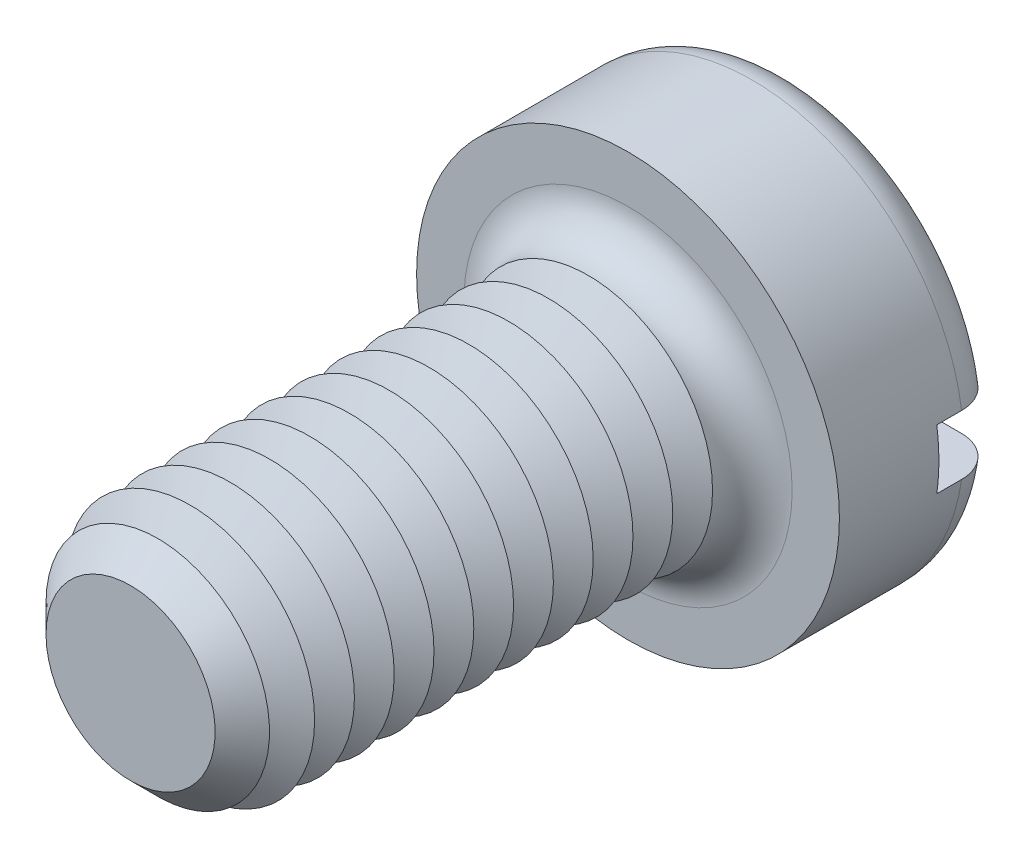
from build123d import *

# Parameters (mm, degrees)
SKETCH3_R           = 4.25
BOSS_EXTRUDE2_DEPTH = 3.3
SKETCH4_R           = 2.5
BOSS_EXTRUDE3_DEPTH = 10
FILLET1_R           = 0.8
CHAMFER1_SIZE       = 0.8
LPATTERN1_COUNT     = 11
LPATTERN1_PITCH     = 0.8
SKETCH8_W           = 8.5
SKETCH8_H           = 1.2
CUT_EXTRUDE1_DEPTH  = 1.3


with BuildPart() as part:
    # Sketch3 → Boss-Extrude2 (new body)
    with BuildSketch(Plane.XY):
        Circle(SKETCH3_R)
    extrude(amount=-BOSS_EXTRUDE2_DEPTH)

    # Sketch4 → Boss-Extrude3 (add)
    with BuildSketch(Plane.XY):
        Circle(SKETCH4_R)
    extrude(amount=BOSS_EXTRUDE3_DEPTH)

    # Fillet1
    fillet1_edges = [part.edges().sort_by_distance(p)[0] for p in [
        (-4.25, 0, -3.3),
        (-2.5, 0, 0),
    ]]
    fillet(fillet1_edges, radius=FILLET1_R)

    # Chamfer1
    chamfer1_edges = [part.edges().sort_by_distance(p)[0] for p in [
        (-2.5, 0, 10),
    ]]
    chamfer(chamfer1_edges, length=CHAMFER1_SIZE)

    # Sketch6 → Cut-Revolve1 (revolve, cut)
    with BuildSketch(Plane(origin=(0, 0, 0), x_dir=(0, 0, -1), z_dir=(1, 0, 0)), mode=Mode.PRIVATE) as cut_revolve1_sk:
        Polygon((-0.8, 2.5), (-1.2, 1.807179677), (-1.6, 2.5), align=None)
    cut_revolve1 = revolve(cut_revolve1_sk.sketch.rotate(Axis((0, 0, -1.694361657), (0, 0, 1)), 90), axis=Axis((0, 0, -1.694361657), (0, 0, 1)), mode=Mode.SUBTRACT)

    # LPattern1: Cut-Revolve1 ×11
    with Locations(*[(0, 0, i * LPATTERN1_PITCH) for i in range(1, LPATTERN1_COUNT)]):
        add(cut_revolve1, mode=Mode.SUBTRACT)

    # Sketch8 → Cut-Extrude1 (cut)
    with BuildSketch(Plane(origin=(0, 0, -3.3), x_dir=(-1, 0, 0), z_dir=(0, 0, -1))):
        Rectangle(SKETCH8_W, SKETCH8_H)
    extrude(amount=-CUT_EXTRUDE1_DEPTH, mode=Mode.SUBTRACT)


solid = part.part
